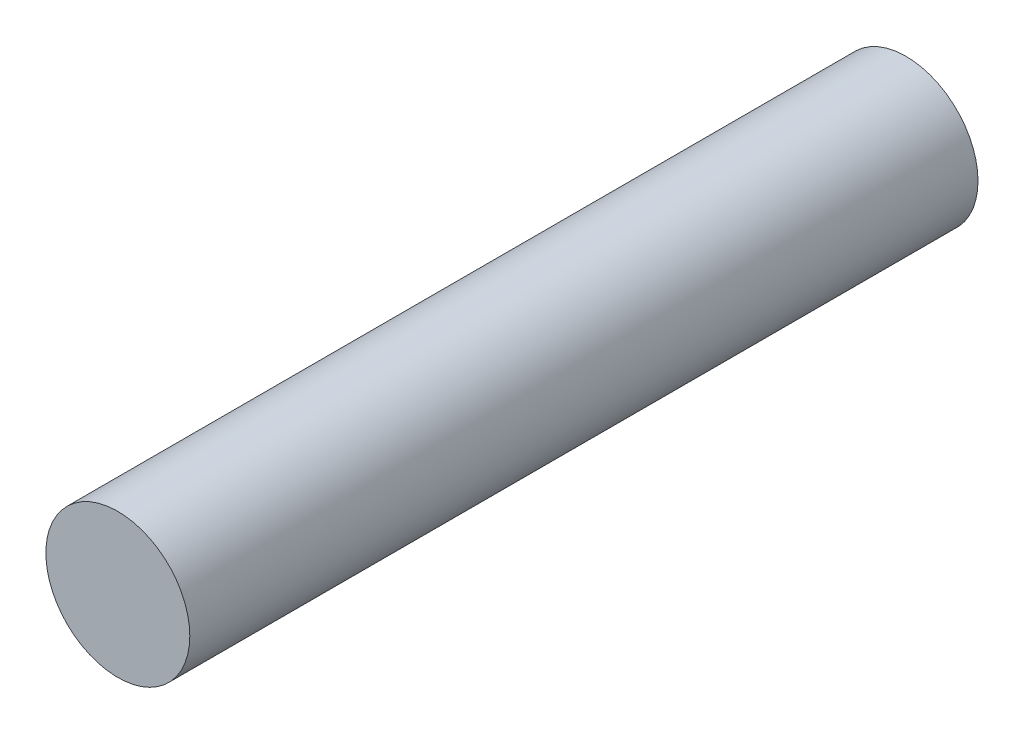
ISO-10303-21;
HEADER;
FILE_DESCRIPTION(('STEP AP214'),'2;1');
FILE_NAME('part.step','',(''),(''),'','','');
FILE_SCHEMA(('AUTOMOTIVE_DESIGN { 1 0 10303 214 1 1 1 1 }'));
ENDSEC;
DATA;
#1=APPLICATION_CONTEXT('core data for automotive mechanical design processes');
#2=APPLICATION_PROTOCOL_DEFINITION('international standard','automotive_design',2000,#1);
#3=PRODUCT_CONTEXT('',#1,'mechanical');
#4=PRODUCT('Part','Part','',(#3));
#5=PRODUCT_RELATED_PRODUCT_CATEGORY('part','',(#4));
#6=PRODUCT_DEFINITION_FORMATION('','',#4);
#7=PRODUCT_DEFINITION_CONTEXT('part definition',#1,'design');
#8=PRODUCT_DEFINITION('design','',#6,#7);
#9=PRODUCT_DEFINITION_SHAPE('','',#8);
#10=(LENGTH_UNIT() NAMED_UNIT(*) SI_UNIT(.MILLI.,.METRE.));
#11=(NAMED_UNIT(*) PLANE_ANGLE_UNIT() SI_UNIT($,.RADIAN.));
#12=(NAMED_UNIT(*) SI_UNIT($,.STERADIAN.) SOLID_ANGLE_UNIT());
#13=UNCERTAINTY_MEASURE_WITH_UNIT(LENGTH_MEASURE(1.E-05),#10,'distance_accuracy_value','');
#14=(GEOMETRIC_REPRESENTATION_CONTEXT(3) GLOBAL_UNCERTAINTY_ASSIGNED_CONTEXT((#13)) GLOBAL_UNIT_ASSIGNED_CONTEXT((#10,
#11,#12)) REPRESENTATION_CONTEXT('',''));
#15=CARTESIAN_POINT('',(0.,0.,0.));
#16=DIRECTION('',(0.,0.,1.));
#17=DIRECTION('',(1.,0.,0.));
#18=AXIS2_PLACEMENT_3D('',#15,#16,#17);
#19=CARTESIAN_POINT('',(0.,0.,146.05));
#20=DIRECTION('',(0.,0.,-1.));
#21=DIRECTION('',(-1.,0.,0.));
#22=AXIS2_PLACEMENT_3D('',#19,#20,#21);
#23=CYLINDRICAL_SURFACE('',#22,13.335);
#24=CARTESIAN_POINT('',(0.,0.,146.05));
#25=DIRECTION('',(0.,0.,1.));
#26=DIRECTION('',(1.,0.,0.));
#27=AXIS2_PLACEMENT_3D('',#24,#25,#26);
#28=CIRCLE('',#27,13.335);
#29=CARTESIAN_POINT('',(13.335,0.,146.05));
#30=VERTEX_POINT('',#29);
#31=EDGE_CURVE('E10',#30,#30,#28,.T.);
#32=ORIENTED_EDGE('',*,*,#31,.F.);
#33=EDGE_LOOP('',(#32));
#34=FACE_BOUND('',#33,.T.);
#35=CARTESIAN_POINT('',(0.,0.,0.));
#36=DIRECTION('',(0.,0.,1.));
#37=DIRECTION('',(1.,0.,0.));
#38=AXIS2_PLACEMENT_3D('',#35,#36,#37);
#39=CIRCLE('',#38,13.335);
#40=CARTESIAN_POINT('',(13.335,0.,0.));
#41=VERTEX_POINT('',#40);
#42=EDGE_CURVE('E38',#41,#41,#39,.T.);
#43=ORIENTED_EDGE('',*,*,#42,.T.);
#44=EDGE_LOOP('',(#43));
#45=FACE_BOUND('',#44,.T.);
#46=ADVANCED_FACE('F35',(#34,#45),#23,.T.);
#47=CARTESIAN_POINT('',(0.,0.,146.05));
#48=DIRECTION('',(0.,0.,1.));
#49=DIRECTION('',(1.,0.,0.));
#50=AXIS2_PLACEMENT_3D('',#47,#48,#49);
#51=PLANE('',#50);
#52=ORIENTED_EDGE('',*,*,#31,.T.);
#53=EDGE_LOOP('',(#52));
#54=FACE_BOUND('',#53,.T.);
#55=ADVANCED_FACE('F50',(#54),#51,.T.);
#56=CARTESIAN_POINT('',(0.,0.,0.));
#57=DIRECTION('',(0.,0.,1.));
#58=DIRECTION('',(1.,0.,0.));
#59=AXIS2_PLACEMENT_3D('',#56,#57,#58);
#60=PLANE('',#59);
#61=ORIENTED_EDGE('',*,*,#42,.F.);
#62=EDGE_LOOP('',(#61));
#63=FACE_BOUND('',#62,.T.);
#64=ADVANCED_FACE('F48',(#63),#60,.F.);
#65=CLOSED_SHELL('',(#46,#55,#64));
#66=MANIFOLD_SOLID_BREP('B2',#65);
#67=ADVANCED_BREP_SHAPE_REPRESENTATION('',(#18,#66),#14);
#68=SHAPE_DEFINITION_REPRESENTATION(#9,#67);
ENDSEC;
END-ISO-10303-21;
